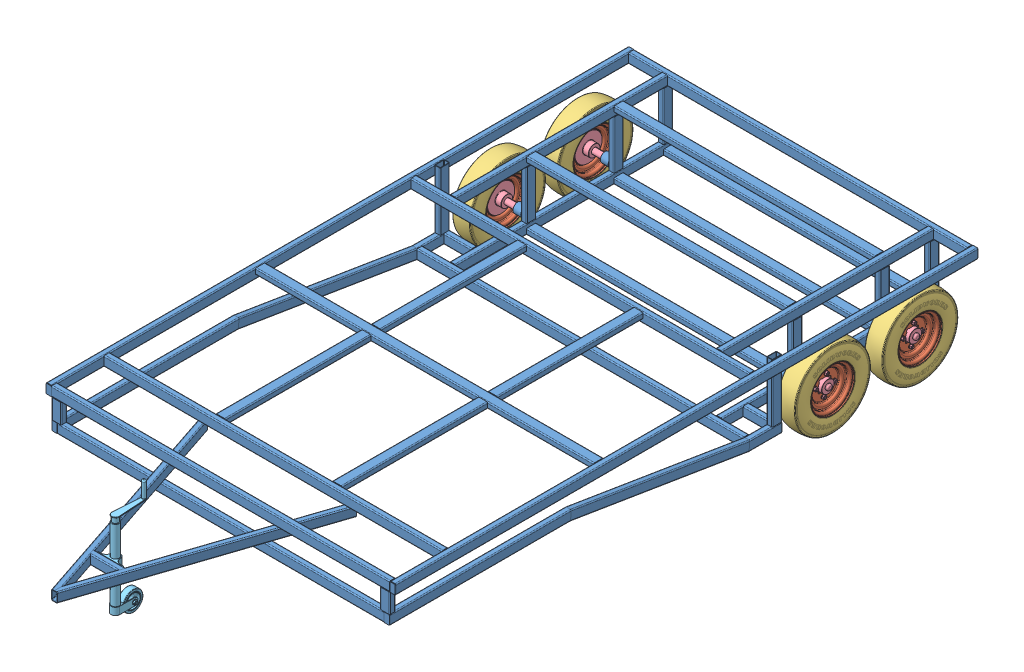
SolidWorks assembly Trailer.SLDASM, configuration Default (file format 11000). Lengths in mm.
Overall size (1800 716.69 3855).
18 component instances, 5 part files, 7 mates.
Components (placement in the parent):
- Frame-1: Frame.SLDPRT [Default<As Machined>] at origin size (1800 350 3855)
- Wheel-1: Wheel.SLDASM [Default] at (836.3649 -275 -1195) x (0 -0.138531 -0.990358) z (1 0 0) size (400 400 149.77)
  - Wheel-1: Wheel.SLDPRT [Default] at origin size (226 226 90)
  - Tyre-2: Tyre.SLDPRT [Default] at origin size (400 400 105.09)
  - Hub-2: Hub.SLDPRT [Default] at origin size (140 140 129)
- Wheel-2: Wheel.SLDASM [Default] at (-836.3649 -275 -1195) x (0 0 1) z (-1 0 0) size (400 400 149.77)
  - Wheel-1: Wheel.SLDPRT [Default] at origin size (226 226 90)
  - Tyre-2: Tyre.SLDPRT [Default] at origin size (400 400 105.09)
  - Hub-2: Hub.SLDPRT [Default] at origin size (140 140 129)
- Jockey Wheel-2: Jockey Wheel.SLDPRT [Default] at (-31.6345 -253.497 1515.3889) x (0 0 1) z (0 1 0) size (184.15 139.7 550.86)
- Wheel-5: Wheel.SLDASM [Default] at (-836.3649 -275 -1645) x (0 0 1) z (-1 0 0) size (400 400 149.77)
  - Wheel-1: Wheel.SLDPRT [Default] at origin size (226 226 90)
  - Tyre-2: Tyre.SLDPRT [Default] at origin size (400 400 105.09)
  - Hub-2: Hub.SLDPRT [Default] at origin size (140 140 129)
- Wheel-6: Wheel.SLDASM [Default] at (836.3649 -275 -1645) x (0 -0.138531 -0.990358) z (1 0 0) size (400 400 149.77)
  - Wheel-1: Wheel.SLDPRT [Default] at origin size (226 226 90)
  - Tyre-2: Tyre.SLDPRT [Default] at origin size (400 400 105.09)
  - Hub-2: Hub.SLDPRT [Default] at origin size (140 140 129)
Mates (geometry in assembly coordinates):
- Coincident3: coincident: Frame-1, Jockey Wheel-2
- Coincident4: coincident: Frame-1, Jockey Wheel-2
- Coincident5: coincident: Jockey Wheel-2
- Coincident6: coincident: Frame-1, Wheel-1
- Concentric3: concentric: Frame-1, Wheel-1
- Coincident7: coincident: Frame-1, Wheel-2
- Concentric4: concentric: Frame-1, Wheel-2
